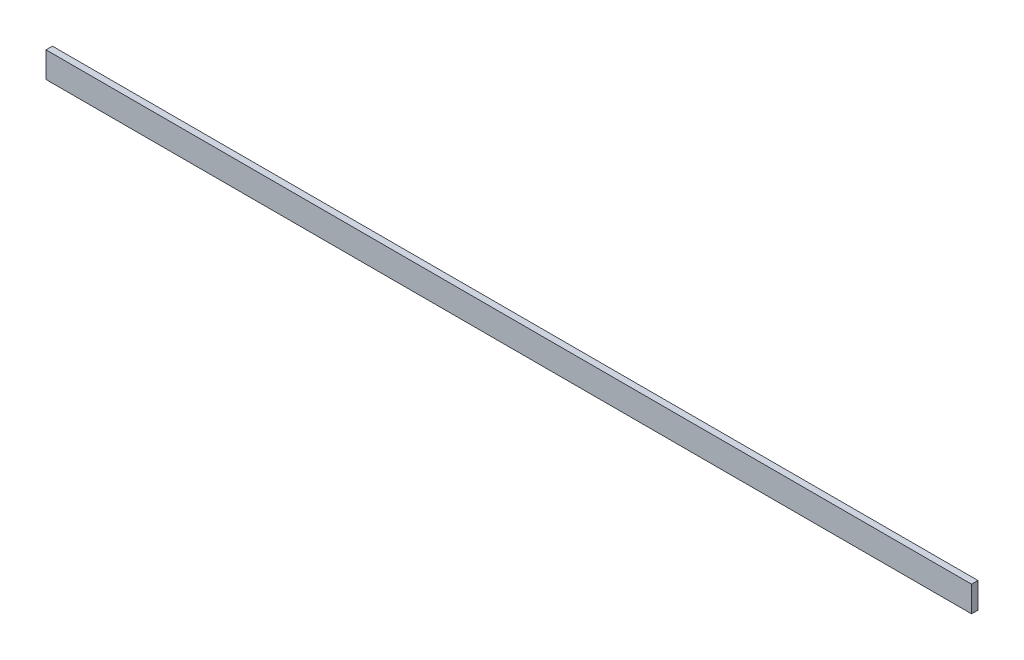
ISO-10303-21;
HEADER;
FILE_DESCRIPTION(('STEP AP214'),'2;1');
FILE_NAME('part.step','',(''),(''),'','','');
FILE_SCHEMA(('AUTOMOTIVE_DESIGN { 1 0 10303 214 1 1 1 1 }'));
ENDSEC;
DATA;
#1=APPLICATION_CONTEXT('core data for automotive mechanical design processes');
#2=APPLICATION_PROTOCOL_DEFINITION('international standard','automotive_design',2000,#1);
#3=PRODUCT_CONTEXT('',#1,'mechanical');
#4=PRODUCT('Part','Part','',(#3));
#5=PRODUCT_RELATED_PRODUCT_CATEGORY('part','',(#4));
#6=PRODUCT_DEFINITION_FORMATION('','',#4);
#7=PRODUCT_DEFINITION_CONTEXT('part definition',#1,'design');
#8=PRODUCT_DEFINITION('design','',#6,#7);
#9=PRODUCT_DEFINITION_SHAPE('','',#8);
#10=(LENGTH_UNIT() NAMED_UNIT(*) SI_UNIT(.MILLI.,.METRE.));
#11=(NAMED_UNIT(*) PLANE_ANGLE_UNIT() SI_UNIT($,.RADIAN.));
#12=(NAMED_UNIT(*) SI_UNIT($,.STERADIAN.) SOLID_ANGLE_UNIT());
#13=UNCERTAINTY_MEASURE_WITH_UNIT(LENGTH_MEASURE(1.E-05),#10,'distance_accuracy_value','');
#14=(GEOMETRIC_REPRESENTATION_CONTEXT(3) GLOBAL_UNCERTAINTY_ASSIGNED_CONTEXT((#13)) GLOBAL_UNIT_ASSIGNED_CONTEXT((#10,
#11,#12)) REPRESENTATION_CONTEXT('',''));
#15=CARTESIAN_POINT('',(0.,0.,0.));
#16=DIRECTION('',(0.,0.,1.));
#17=DIRECTION('',(1.,0.,0.));
#18=AXIS2_PLACEMENT_3D('',#15,#16,#17);
#19=CARTESIAN_POINT('',(457.2,-6.34999999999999,3.175));
#20=DIRECTION('',(0.,1.,0.));
#21=DIRECTION('',(0.,0.,1.));
#22=AXIS2_PLACEMENT_3D('',#19,#20,#21);
#23=PLANE('',#22);
#24=DIRECTION('',(0.,0.,-1.));
#25=VECTOR('',#24,1.);
#26=CARTESIAN_POINT('',(0.,-6.34999999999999,3.175));
#27=LINE('',#26,#25);
#28=CARTESIAN_POINT('',(0.,-6.34999999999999,3.175));
#29=VERTEX_POINT('',#28);
#30=CARTESIAN_POINT('',(0.,-6.34999999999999,0.));
#31=VERTEX_POINT('',#30);
#32=EDGE_CURVE('E115',#29,#31,#27,.T.);
#33=ORIENTED_EDGE('',*,*,#32,.T.);
#34=DIRECTION('',(-1.,0.,0.));
#35=VECTOR('',#34,1.);
#36=CARTESIAN_POINT('',(457.2,-6.34999999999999,0.));
#37=LINE('',#36,#35);
#38=CARTESIAN_POINT('',(457.2,-6.34999999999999,0.));
#39=VERTEX_POINT('',#38);
#40=EDGE_CURVE('E11',#39,#31,#37,.T.);
#41=ORIENTED_EDGE('',*,*,#40,.F.);
#42=DIRECTION('',(0.,0.,-1.));
#43=VECTOR('',#42,1.);
#44=CARTESIAN_POINT('',(457.2,-6.34999999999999,3.175));
#45=LINE('',#44,#43);
#46=CARTESIAN_POINT('',(457.2,-6.34999999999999,3.175));
#47=VERTEX_POINT('',#46);
#48=EDGE_CURVE('E94',#47,#39,#45,.T.);
#49=ORIENTED_EDGE('',*,*,#48,.F.);
#50=DIRECTION('',(-1.,0.,0.));
#51=VECTOR('',#50,1.);
#52=CARTESIAN_POINT('',(457.2,-6.34999999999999,3.175));
#53=LINE('',#52,#51);
#54=EDGE_CURVE('E106',#47,#29,#53,.T.);
#55=ORIENTED_EDGE('',*,*,#54,.T.);
#56=EDGE_LOOP('',(#33,#41,#49,#55));
#57=FACE_BOUND('',#56,.T.);
#58=ADVANCED_FACE('F43',(#57),#23,.F.);
#59=CARTESIAN_POINT('',(457.2,-6.34999999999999,0.));
#60=DIRECTION('',(0.,0.,1.));
#61=DIRECTION('',(1.,0.,0.));
#62=AXIS2_PLACEMENT_3D('',#59,#60,#61);
#63=PLANE('',#62);
#64=DIRECTION('',(0.,1.,0.));
#65=VECTOR('',#64,1.);
#66=CARTESIAN_POINT('',(0.,-6.34999999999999,0.));
#67=LINE('',#66,#65);
#68=CARTESIAN_POINT('',(0.,6.34999999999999,0.));
#69=VERTEX_POINT('',#68);
#70=EDGE_CURVE('E99',#31,#69,#67,.T.);
#71=ORIENTED_EDGE('',*,*,#70,.T.);
#72=DIRECTION('',(-1.,0.,0.));
#73=VECTOR('',#72,1.);
#74=CARTESIAN_POINT('',(457.2,6.34999999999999,0.));
#75=LINE('',#74,#73);
#76=CARTESIAN_POINT('',(457.2,6.34999999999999,0.));
#77=VERTEX_POINT('',#76);
#78=EDGE_CURVE('E55',#77,#69,#75,.T.);
#79=ORIENTED_EDGE('',*,*,#78,.F.);
#80=DIRECTION('',(0.,1.,0.));
#81=VECTOR('',#80,1.);
#82=CARTESIAN_POINT('',(457.2,-6.34999999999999,0.));
#83=LINE('',#82,#81);
#84=EDGE_CURVE('E89',#39,#77,#83,.T.);
#85=ORIENTED_EDGE('',*,*,#84,.F.);
#86=ORIENTED_EDGE('',*,*,#40,.T.);
#87=EDGE_LOOP('',(#71,#79,#85,#86));
#88=FACE_BOUND('',#87,.T.);
#89=ADVANCED_FACE('F98',(#88),#63,.F.);
#90=CARTESIAN_POINT('',(457.2,6.34999999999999,0.));
#91=DIRECTION('',(0.,-1.,0.));
#92=DIRECTION('',(0.,0.,-1.));
#93=AXIS2_PLACEMENT_3D('',#90,#91,#92);
#94=PLANE('',#93);
#95=DIRECTION('',(0.,0.,1.));
#96=VECTOR('',#95,1.);
#97=CARTESIAN_POINT('',(0.,6.34999999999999,0.));
#98=LINE('',#97,#96);
#99=CARTESIAN_POINT('',(0.,6.34999999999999,3.175));
#100=VERTEX_POINT('',#99);
#101=EDGE_CURVE('E77',#69,#100,#98,.T.);
#102=ORIENTED_EDGE('',*,*,#101,.T.);
#103=DIRECTION('',(-1.,0.,0.));
#104=VECTOR('',#103,1.);
#105=CARTESIAN_POINT('',(457.2,6.34999999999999,3.175));
#106=LINE('',#105,#104);
#107=CARTESIAN_POINT('',(457.2,6.34999999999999,3.175));
#108=VERTEX_POINT('',#107);
#109=EDGE_CURVE('E105',#108,#100,#106,.T.);
#110=ORIENTED_EDGE('',*,*,#109,.F.);
#111=DIRECTION('',(0.,0.,1.));
#112=VECTOR('',#111,1.);
#113=CARTESIAN_POINT('',(457.2,6.34999999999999,0.));
#114=LINE('',#113,#112);
#115=EDGE_CURVE('E93',#77,#108,#114,.T.);
#116=ORIENTED_EDGE('',*,*,#115,.F.);
#117=ORIENTED_EDGE('',*,*,#78,.T.);
#118=EDGE_LOOP('',(#102,#110,#116,#117));
#119=FACE_BOUND('',#118,.T.);
#120=ADVANCED_FACE('F104',(#119),#94,.F.);
#121=CARTESIAN_POINT('',(457.2,6.34999999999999,3.175));
#122=DIRECTION('',(0.,0.,-1.));
#123=DIRECTION('',(-1.,0.,0.));
#124=AXIS2_PLACEMENT_3D('',#121,#122,#123);
#125=PLANE('',#124);
#126=DIRECTION('',(0.,-1.,0.));
#127=VECTOR('',#126,1.);
#128=CARTESIAN_POINT('',(0.,6.34999999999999,3.175));
#129=LINE('',#128,#127);
#130=EDGE_CURVE('E81',#100,#29,#129,.T.);
#131=ORIENTED_EDGE('',*,*,#130,.T.);
#132=ORIENTED_EDGE('',*,*,#54,.F.);
#133=DIRECTION('',(0.,-1.,0.));
#134=VECTOR('',#133,1.);
#135=CARTESIAN_POINT('',(457.2,6.34999999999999,3.175));
#136=LINE('',#135,#134);
#137=EDGE_CURVE('E58',#108,#47,#136,.T.);
#138=ORIENTED_EDGE('',*,*,#137,.F.);
#139=ORIENTED_EDGE('',*,*,#109,.T.);
#140=EDGE_LOOP('',(#131,#132,#138,#139));
#141=FACE_BOUND('',#140,.T.);
#142=ADVANCED_FACE('F128',(#141),#125,.F.);
#143=CARTESIAN_POINT('',(457.2,0.,0.));
#144=DIRECTION('',(1.,0.,0.));
#145=DIRECTION('',(0.,0.,-1.));
#146=AXIS2_PLACEMENT_3D('',#143,#144,#145);
#147=PLANE('',#146);
#148=ORIENTED_EDGE('',*,*,#48,.T.);
#149=ORIENTED_EDGE('',*,*,#84,.T.);
#150=ORIENTED_EDGE('',*,*,#115,.T.);
#151=ORIENTED_EDGE('',*,*,#137,.T.);
#152=EDGE_LOOP('',(#148,#149,#150,#151));
#153=FACE_BOUND('',#152,.T.);
#154=ADVANCED_FACE('F91',(#153),#147,.T.);
#155=CARTESIAN_POINT('',(0.,0.,0.));
#156=DIRECTION('',(1.,0.,0.));
#157=DIRECTION('',(0.,0.,-1.));
#158=AXIS2_PLACEMENT_3D('',#155,#156,#157);
#159=PLANE('',#158);
#160=ORIENTED_EDGE('',*,*,#32,.F.);
#161=ORIENTED_EDGE('',*,*,#130,.F.);
#162=ORIENTED_EDGE('',*,*,#101,.F.);
#163=ORIENTED_EDGE('',*,*,#70,.F.);
#164=EDGE_LOOP('',(#160,#161,#162,#163));
#165=FACE_BOUND('',#164,.T.);
#166=ADVANCED_FACE('F129',(#165),#159,.F.);
#167=CLOSED_SHELL('',(#58,#89,#120,#142,#154,#166));
#168=MANIFOLD_SOLID_BREP('B2',#167);
#169=ADVANCED_BREP_SHAPE_REPRESENTATION('',(#18,#168),#14);
#170=SHAPE_DEFINITION_REPRESENTATION(#9,#169);
ENDSEC;
END-ISO-10303-21;
